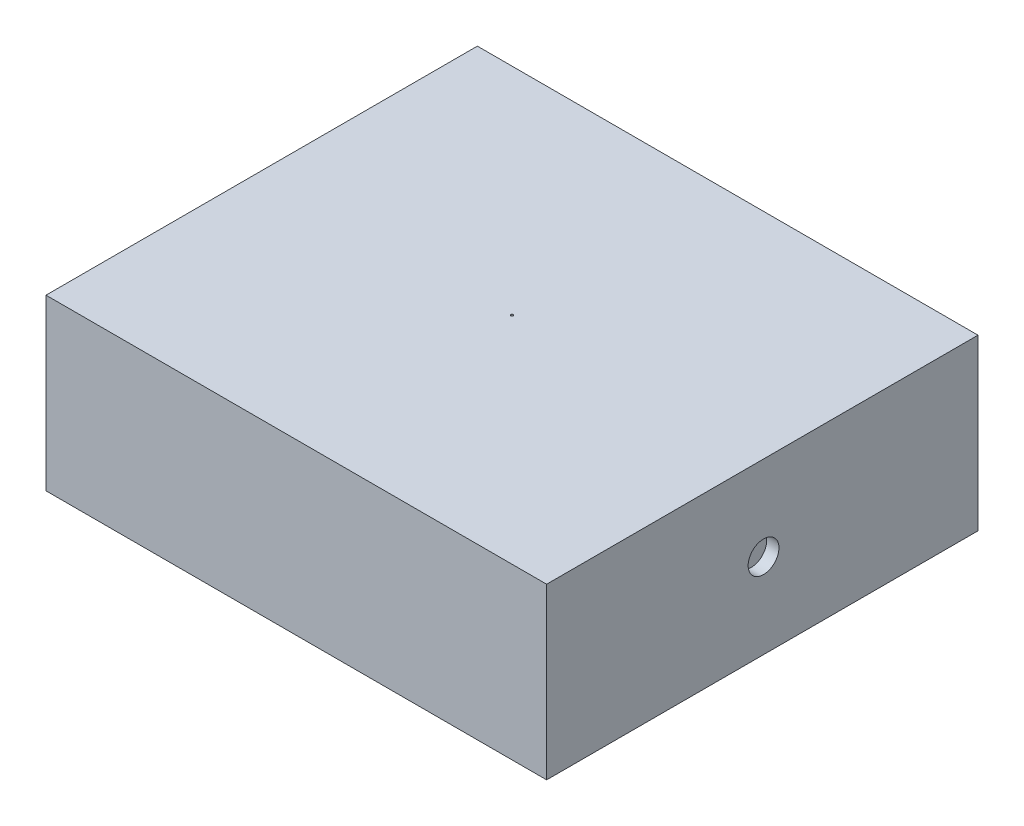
ISO-10303-21;
HEADER;
FILE_DESCRIPTION(('STEP AP214'),'2;1');
FILE_NAME('part.step','',(''),(''),'','','');
FILE_SCHEMA(('AUTOMOTIVE_DESIGN { 1 0 10303 214 1 1 1 1 }'));
ENDSEC;
DATA;
#1=APPLICATION_CONTEXT('core data for automotive mechanical design processes');
#2=APPLICATION_PROTOCOL_DEFINITION('international standard','automotive_design',2000,#1);
#3=PRODUCT_CONTEXT('',#1,'mechanical');
#4=PRODUCT('Part','Part','',(#3));
#5=PRODUCT_RELATED_PRODUCT_CATEGORY('part','',(#4));
#6=PRODUCT_DEFINITION_FORMATION('','',#4);
#7=PRODUCT_DEFINITION_CONTEXT('part definition',#1,'design');
#8=PRODUCT_DEFINITION('design','',#6,#7);
#9=PRODUCT_DEFINITION_SHAPE('','',#8);
#10=(LENGTH_UNIT() NAMED_UNIT(*) SI_UNIT(.MILLI.,.METRE.));
#11=(NAMED_UNIT(*) PLANE_ANGLE_UNIT() SI_UNIT($,.RADIAN.));
#12=(NAMED_UNIT(*) SI_UNIT($,.STERADIAN.) SOLID_ANGLE_UNIT());
#13=UNCERTAINTY_MEASURE_WITH_UNIT(LENGTH_MEASURE(1.E-05),#10,'distance_accuracy_value','');
#14=(GEOMETRIC_REPRESENTATION_CONTEXT(3) GLOBAL_UNCERTAINTY_ASSIGNED_CONTEXT((#13)) GLOBAL_UNIT_ASSIGNED_CONTEXT((#10,
#11,#12)) REPRESENTATION_CONTEXT('',''));
#15=CARTESIAN_POINT('',(0.,0.,0.));
#16=DIRECTION('',(0.,0.,1.));
#17=DIRECTION('',(1.,0.,0.));
#18=AXIS2_PLACEMENT_3D('',#15,#16,#17);
#19=CARTESIAN_POINT('',(-51.5874,-34.925,44.45));
#20=DIRECTION('',(-1.,0.,0.));
#21=DIRECTION('',(0.,0.,1.));
#22=AXIS2_PLACEMENT_3D('',#19,#20,#21);
#23=PLANE('',#22);
#24=DIRECTION('',(0.,0.,1.));
#25=VECTOR('',#24,1.);
#26=CARTESIAN_POINT('',(-51.5874,0.,44.45));
#27=LINE('',#26,#25);
#28=CARTESIAN_POINT('',(-51.5874,0.,-44.45));
#29=VERTEX_POINT('',#28);
#30=CARTESIAN_POINT('',(-51.5874,0.,44.45));
#31=VERTEX_POINT('',#30);
#32=EDGE_CURVE('E97',#29,#31,#27,.T.);
#33=ORIENTED_EDGE('',*,*,#32,.F.);
#34=DIRECTION('',(0.,1.,0.));
#35=VECTOR('',#34,1.);
#36=CARTESIAN_POINT('',(-51.5874,-34.925,-44.45));
#37=LINE('',#36,#35);
#38=CARTESIAN_POINT('',(-51.5874,-34.925,-44.45));
#39=VERTEX_POINT('',#38);
#40=EDGE_CURVE('E11',#39,#29,#37,.T.);
#41=ORIENTED_EDGE('',*,*,#40,.F.);
#42=DIRECTION('',(0.,0.,1.));
#43=VECTOR('',#42,1.);
#44=CARTESIAN_POINT('',(-51.5874,-34.925,44.45));
#45=LINE('',#44,#43);
#46=CARTESIAN_POINT('',(-51.5874,-34.925,44.45));
#47=VERTEX_POINT('',#46);
#48=EDGE_CURVE('E90',#39,#47,#45,.T.);
#49=ORIENTED_EDGE('',*,*,#48,.T.);
#50=DIRECTION('',(0.,1.,0.));
#51=VECTOR('',#50,1.);
#52=CARTESIAN_POINT('',(-51.5874,-34.925,44.45));
#53=LINE('',#52,#51);
#54=EDGE_CURVE('E35',#47,#31,#53,.T.);
#55=ORIENTED_EDGE('',*,*,#54,.T.);
#56=EDGE_LOOP('',(#33,#41,#49,#55));
#57=FACE_BOUND('',#56,.T.);
#58=ADVANCED_FACE('F32',(#57),#23,.T.);
#59=CARTESIAN_POINT('',(-51.5874,-34.925,-44.45));
#60=DIRECTION('',(0.,0.,-1.));
#61=DIRECTION('',(-1.,0.,0.));
#62=AXIS2_PLACEMENT_3D('',#59,#60,#61);
#63=PLANE('',#62);
#64=DIRECTION('',(-1.,0.,0.));
#65=VECTOR('',#64,1.);
#66=CARTESIAN_POINT('',(-51.5874,0.,-44.45));
#67=LINE('',#66,#65);
#68=CARTESIAN_POINT('',(51.5874,0.,-44.45));
#69=VERTEX_POINT('',#68);
#70=EDGE_CURVE('E92',#69,#29,#67,.T.);
#71=ORIENTED_EDGE('',*,*,#70,.F.);
#72=DIRECTION('',(0.,1.,0.));
#73=VECTOR('',#72,1.);
#74=CARTESIAN_POINT('',(51.5874,-34.925,-44.45));
#75=LINE('',#74,#73);
#76=CARTESIAN_POINT('',(51.5874,-34.925,-44.45));
#77=VERTEX_POINT('',#76);
#78=EDGE_CURVE('E41',#77,#69,#75,.T.);
#79=ORIENTED_EDGE('',*,*,#78,.F.);
#80=DIRECTION('',(-1.,0.,0.));
#81=VECTOR('',#80,1.);
#82=CARTESIAN_POINT('',(-51.5874,-34.925,-44.45));
#83=LINE('',#82,#81);
#84=EDGE_CURVE('E87',#77,#39,#83,.T.);
#85=ORIENTED_EDGE('',*,*,#84,.T.);
#86=ORIENTED_EDGE('',*,*,#40,.T.);
#87=EDGE_LOOP('',(#71,#79,#85,#86));
#88=FACE_BOUND('',#87,.T.);
#89=ADVANCED_FACE('F108',(#88),#63,.T.);
#90=CARTESIAN_POINT('',(51.5874,-34.925,44.45));
#91=DIRECTION('',(1.,0.,0.));
#92=DIRECTION('',(0.,0.,-1.));
#93=AXIS2_PLACEMENT_3D('',#90,#91,#92);
#94=PLANE('',#93);
#95=CARTESIAN_POINT('',(51.5874,-17.4498,-0.253999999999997));
#96=DIRECTION('',(1.,0.,0.));
#97=DIRECTION('',(0.,0.,-1.));
#98=AXIS2_PLACEMENT_3D('',#95,#96,#97);
#99=CIRCLE('',#98,3.175);
#100=CARTESIAN_POINT('',(51.5874,-17.4498,-3.429));
#101=VERTEX_POINT('',#100);
#102=EDGE_CURVE('E148',#101,#101,#99,.T.);
#103=ORIENTED_EDGE('',*,*,#102,.F.);
#104=EDGE_LOOP('',(#103));
#105=FACE_BOUND('',#104,.T.);
#106=DIRECTION('',(0.,0.,-1.));
#107=VECTOR('',#106,1.);
#108=CARTESIAN_POINT('',(51.5874,0.,44.45));
#109=LINE('',#108,#107);
#110=CARTESIAN_POINT('',(51.5874,0.,44.45));
#111=VERTEX_POINT('',#110);
#112=EDGE_CURVE('E82',#111,#69,#109,.T.);
#113=ORIENTED_EDGE('',*,*,#112,.F.);
#114=DIRECTION('',(0.,1.,0.));
#115=VECTOR('',#114,1.);
#116=CARTESIAN_POINT('',(51.5874,-34.925,44.45));
#117=LINE('',#116,#115);
#118=CARTESIAN_POINT('',(51.5874,-34.925,44.45));
#119=VERTEX_POINT('',#118);
#120=EDGE_CURVE('E77',#119,#111,#117,.T.);
#121=ORIENTED_EDGE('',*,*,#120,.F.);
#122=DIRECTION('',(0.,0.,-1.));
#123=VECTOR('',#122,1.);
#124=CARTESIAN_POINT('',(51.5874,-34.925,44.45));
#125=LINE('',#124,#123);
#126=EDGE_CURVE('E80',#119,#77,#125,.T.);
#127=ORIENTED_EDGE('',*,*,#126,.T.);
#128=ORIENTED_EDGE('',*,*,#78,.T.);
#129=EDGE_LOOP('',(#113,#121,#127,#128));
#130=FACE_BOUND('',#129,.T.);
#131=ADVANCED_FACE('F79',(#105,#130),#94,.T.);
#132=CARTESIAN_POINT('',(-51.5874,-34.925,44.45));
#133=DIRECTION('',(0.,0.,1.));
#134=DIRECTION('',(1.,0.,0.));
#135=AXIS2_PLACEMENT_3D('',#132,#133,#134);
#136=PLANE('',#135);
#137=DIRECTION('',(1.,0.,0.));
#138=VECTOR('',#137,1.);
#139=CARTESIAN_POINT('',(-51.5874,0.,44.45));
#140=LINE('',#139,#138);
#141=EDGE_CURVE('E100',#31,#111,#140,.T.);
#142=ORIENTED_EDGE('',*,*,#141,.F.);
#143=ORIENTED_EDGE('',*,*,#54,.F.);
#144=DIRECTION('',(1.,0.,0.));
#145=VECTOR('',#144,1.);
#146=CARTESIAN_POINT('',(-51.5874,-34.925,44.45));
#147=LINE('',#146,#145);
#148=EDGE_CURVE('E86',#47,#119,#147,.T.);
#149=ORIENTED_EDGE('',*,*,#148,.T.);
#150=ORIENTED_EDGE('',*,*,#120,.T.);
#151=EDGE_LOOP('',(#142,#143,#149,#150));
#152=FACE_BOUND('',#151,.T.);
#153=ADVANCED_FACE('F89',(#152),#136,.T.);
#154=CARTESIAN_POINT('',(0.,-34.925,0.));
#155=DIRECTION('',(0.,-1.,0.));
#156=DIRECTION('',(0.,0.,-1.));
#157=AXIS2_PLACEMENT_3D('',#154,#155,#156);
#158=PLANE('',#157);
#159=CARTESIAN_POINT('',(0.,-34.925,0.));
#160=DIRECTION('',(0.,1.,0.));
#161=DIRECTION('',(0.,0.,1.));
#162=AXIS2_PLACEMENT_3D('',#159,#160,#161);
#163=CIRCLE('',#162,0.254);
#164=CARTESIAN_POINT('',(0.,-34.925,0.254));
#165=VERTEX_POINT('',#164);
#166=EDGE_CURVE('E101',#165,#165,#163,.T.);
#167=ORIENTED_EDGE('',*,*,#166,.T.);
#168=EDGE_LOOP('',(#167));
#169=FACE_BOUND('',#168,.T.);
#170=ORIENTED_EDGE('',*,*,#48,.F.);
#171=ORIENTED_EDGE('',*,*,#84,.F.);
#172=ORIENTED_EDGE('',*,*,#126,.F.);
#173=ORIENTED_EDGE('',*,*,#148,.F.);
#174=EDGE_LOOP('',(#170,#171,#172,#173));
#175=FACE_BOUND('',#174,.T.);
#176=ADVANCED_FACE('F85',(#169,#175),#158,.T.);
#177=CARTESIAN_POINT('',(0.,0.,0.));
#178=DIRECTION('',(0.,-1.,0.));
#179=DIRECTION('',(0.,0.,-1.));
#180=AXIS2_PLACEMENT_3D('',#177,#178,#179);
#181=PLANE('',#180);
#182=CARTESIAN_POINT('',(0.,0.,0.));
#183=DIRECTION('',(0.,1.,0.));
#184=DIRECTION('',(0.,0.,1.));
#185=AXIS2_PLACEMENT_3D('',#182,#183,#184);
#186=CIRCLE('',#185,0.254);
#187=CARTESIAN_POINT('',(0.,0.,0.254));
#188=VERTEX_POINT('',#187);
#189=EDGE_CURVE('E147',#188,#188,#186,.T.);
#190=ORIENTED_EDGE('',*,*,#189,.F.);
#191=EDGE_LOOP('',(#190));
#192=FACE_BOUND('',#191,.T.);
#193=ORIENTED_EDGE('',*,*,#32,.T.);
#194=ORIENTED_EDGE('',*,*,#141,.T.);
#195=ORIENTED_EDGE('',*,*,#112,.T.);
#196=ORIENTED_EDGE('',*,*,#70,.T.);
#197=EDGE_LOOP('',(#193,#194,#195,#196));
#198=FACE_BOUND('',#197,.T.);
#199=ADVANCED_FACE('F107',(#192,#198),#181,.F.);
#200=CARTESIAN_POINT('',(0.,-34.925,0.));
#201=DIRECTION('',(0.,1.,0.));
#202=DIRECTION('',(0.,0.,1.));
#203=AXIS2_PLACEMENT_3D('',#200,#201,#202);
#204=CYLINDRICAL_SURFACE('',#203,0.254);
#205=ORIENTED_EDGE('',*,*,#166,.F.);
#206=EDGE_LOOP('',(#205));
#207=FACE_BOUND('',#206,.T.);
#208=ORIENTED_EDGE('',*,*,#189,.T.);
#209=EDGE_LOOP('',(#208));
#210=FACE_BOUND('',#209,.T.);
#211=ADVANCED_FACE('F128',(#207,#210),#204,.F.);
#212=CARTESIAN_POINT('',(49.0474,-17.4498,-0.253999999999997));
#213=DIRECTION('',(1.,0.,0.));
#214=DIRECTION('',(0.,0.,-1.));
#215=AXIS2_PLACEMENT_3D('',#212,#213,#214);
#216=CYLINDRICAL_SURFACE('',#215,3.175);
#217=CARTESIAN_POINT('',(49.0474,-17.4498,-0.253999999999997));
#218=DIRECTION('',(1.,0.,0.));
#219=DIRECTION('',(0.,0.,-1.));
#220=AXIS2_PLACEMENT_3D('',#217,#218,#219);
#221=CIRCLE('',#220,3.175);
#222=CARTESIAN_POINT('',(49.0474,-17.4498,-3.429));
#223=VERTEX_POINT('',#222);
#224=EDGE_CURVE('E146',#223,#223,#221,.T.);
#225=ORIENTED_EDGE('',*,*,#224,.F.);
#226=EDGE_LOOP('',(#225));
#227=FACE_BOUND('',#226,.T.);
#228=ORIENTED_EDGE('',*,*,#102,.T.);
#229=EDGE_LOOP('',(#228));
#230=FACE_BOUND('',#229,.T.);
#231=ADVANCED_FACE('F134',(#227,#230),#216,.F.);
#232=CARTESIAN_POINT('',(49.0474,-17.4498,-0.253999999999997));
#233=DIRECTION('',(1.,0.,0.));
#234=DIRECTION('',(0.,0.,-1.));
#235=AXIS2_PLACEMENT_3D('',#232,#233,#234);
#236=PLANE('',#235);
#237=ORIENTED_EDGE('',*,*,#224,.T.);
#238=EDGE_LOOP('',(#237));
#239=FACE_BOUND('',#238,.T.);
#240=ADVANCED_FACE('F138',(#239),#236,.T.);
#241=CLOSED_SHELL('',(#58,#89,#131,#153,#176,#199,#211,#231,#240));
#242=MANIFOLD_SOLID_BREP('B2',#241);
#243=ADVANCED_BREP_SHAPE_REPRESENTATION('',(#18,#242),#14);
#244=SHAPE_DEFINITION_REPRESENTATION(#9,#243);
ENDSEC;
END-ISO-10303-21;
